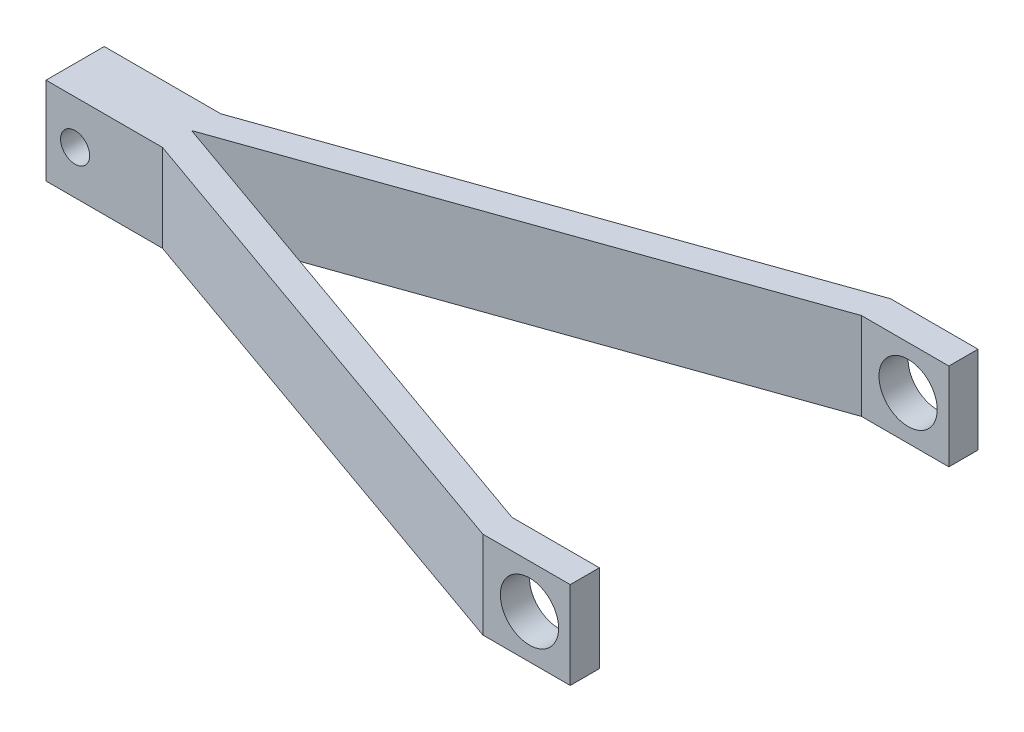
from build123d import *

# Parameters (mm, degrees)
BOSS_EXTRUDE1_DEPTH = 7.5
SKETCH2_R           = 5
CUT_EXTRUDE1_DEPTH  = 123.295748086
SKETCH3_R           = 2.5
CUT_EXTRUDE2_DEPTH  = 108.964114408


with BuildPart() as part:
    # Sketch1 → Boss-Extrude1 (new, symmetric)
    with BuildSketch(Plane(origin=(0, 0, 0), x_dir=(1, 0, 0), z_dir=(0, 1, 0))):
        Polygon((-20, 0), (0, 0), (85, 30), (100, 30), (100, 35), (85, 35), (0, 5), (-20, 5), align=None)
        Polygon((85, -35), (100, -35), (100, -30), (85, -30), (0, 0), (-20, 0), (-20, -5), (0, -5), align=None)
    extrude(amount=BOSS_EXTRUDE1_DEPTH, both=True)

    # Sketch2 → Cut-Extrude1 (cut, through all)
    with BuildSketch(Plane.XY.offset(35)):
        with Locations((93, 0)):
            Circle(SKETCH2_R)
    extrude(amount=-CUT_EXTRUDE1_DEPTH, mode=Mode.SUBTRACT)

    # Sketch3 → Cut-Extrude2 (cut, through all)
    with BuildSketch(Plane.XY.offset(5)):
        with Locations((-15, 0)):
            Circle(SKETCH3_R)
    extrude(amount=-CUT_EXTRUDE2_DEPTH, mode=Mode.SUBTRACT)


solid = part.part
